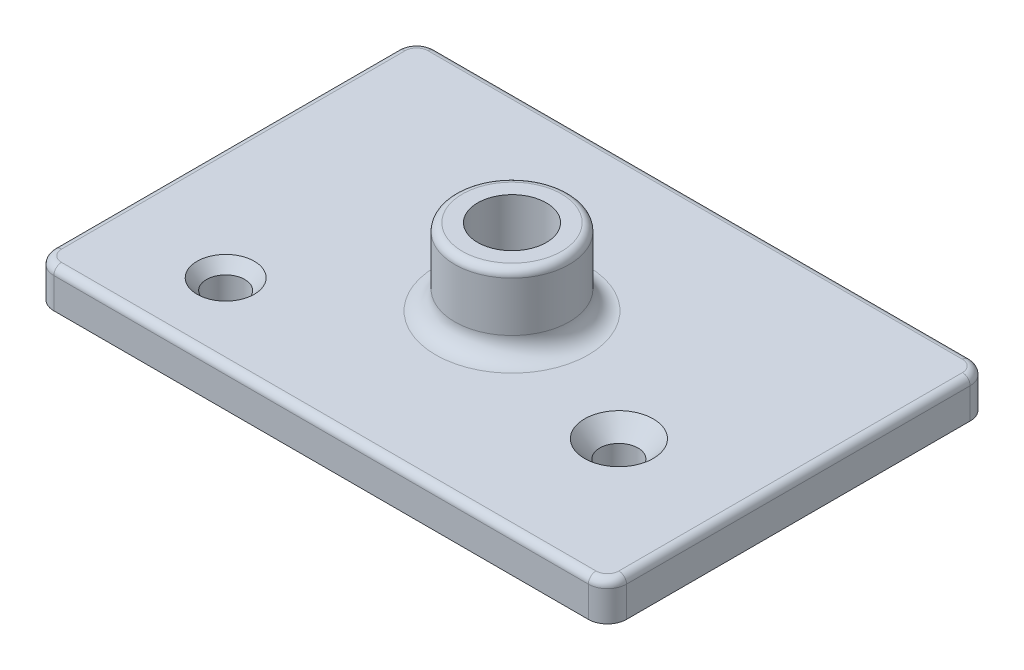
from build123d import *

# Parameters (mm, degrees)
SKETCH1_W           = 150
SKETCH1_H           = 100
BASE_EXTRUDE_DEPTH  = 10
SKETCH2_R           = 15
BOSS_EXTRUDE1_DEPTH = 20
SKETCH3_R           = 9
CUT_EXTRUDE1_DEPTH  = 25
HOLE1_D             = 10
HOLE1_CSINK_D       = 15
HOLE1_CSINK_ANGLE   = 82
FILLET2_R           = 5
FILLET1_R           = 2


with BuildPart() as part:
    # Sketch1 → Base-Extrude (new body)
    with BuildSketch(Plane(origin=(0, 0, 0), x_dir=(1, 0, 0), z_dir=(0, 1, 0))):
        Rectangle(SKETCH1_W, SKETCH1_H)
    extrude(amount=BASE_EXTRUDE_DEPTH)

    # Sketch2 → Boss-Extrude1 (add)
    with BuildSketch(Plane(origin=(0, 10, 0), x_dir=(-1, 0, 0), z_dir=(0, 1, 0))):
        with Locations(Location((0, 0, 0), (0, 0, 90))):
            Circle(SKETCH2_R)
    extrude(amount=BOSS_EXTRUDE1_DEPTH)

    # Sketch3 → Cut-Extrude1 (cut)
    with BuildSketch(Plane(origin=(0, 30, 0), x_dir=(-1, 0, 0), z_dir=(0, 1, 0))):
        with Locations(Location((0, 0, 0), (0, 0, 90))):
            Circle(SKETCH3_R)
    extrude(amount=-CUT_EXTRUDE1_DEPTH, mode=Mode.SUBTRACT)

    # Hole1 (through all)
    with Locations(Plane(origin=(0, 10, 0), x_dir=(-1, 0, 0), z_dir=(0, 1, 0))):
        with Locations((45, 30)):
            CounterSinkHole(HOLE1_D / 2, HOLE1_CSINK_D / 2, counter_sink_angle=HOLE1_CSINK_ANGLE)

    # Sketch9 → Hole2 (revolve, cut)
    with BuildSketch(Plane(origin=(43, 10, 15), x_dir=(0, 0, 1), z_dir=(1, 0, 0))):
        Polygon((0, 0), (0, 10), (5, 10), (5, 4.601473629), (9, 0), align=None)
    revolve(axis=Axis((43, 16.445314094, 15), (0, -1, 0)), mode=Mode.SUBTRACT)

    # Fillet2
    fillet2_edges = [part.edges().sort_by_distance(p)[0] for p in [
        (0, 10, -15),
        (-75, 5, -50),
        (75, 5, -50),
        (75, 5, 50),
        (-75, 5, 50),
    ]]
    fillet(fillet2_edges, radius=FILLET2_R)

    # Fillet1
    fillet1_edges = [part.edges().sort_by_distance(p)[0] for p in [
        (0, 30, -15),
        (-75, 10, 0),
        (0, 10, 50),
        (75, 10, 0),
        (0, 10, -50),
        (73.535533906, 10, 48.535533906),
        (73.535533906, 10, -48.535533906),
        (-73.535533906, 10, -48.535533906),
        (-73.535533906, 10, 48.535533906),
    ]]
    fillet(fillet1_edges, radius=FILLET1_R)


solid = part.part
